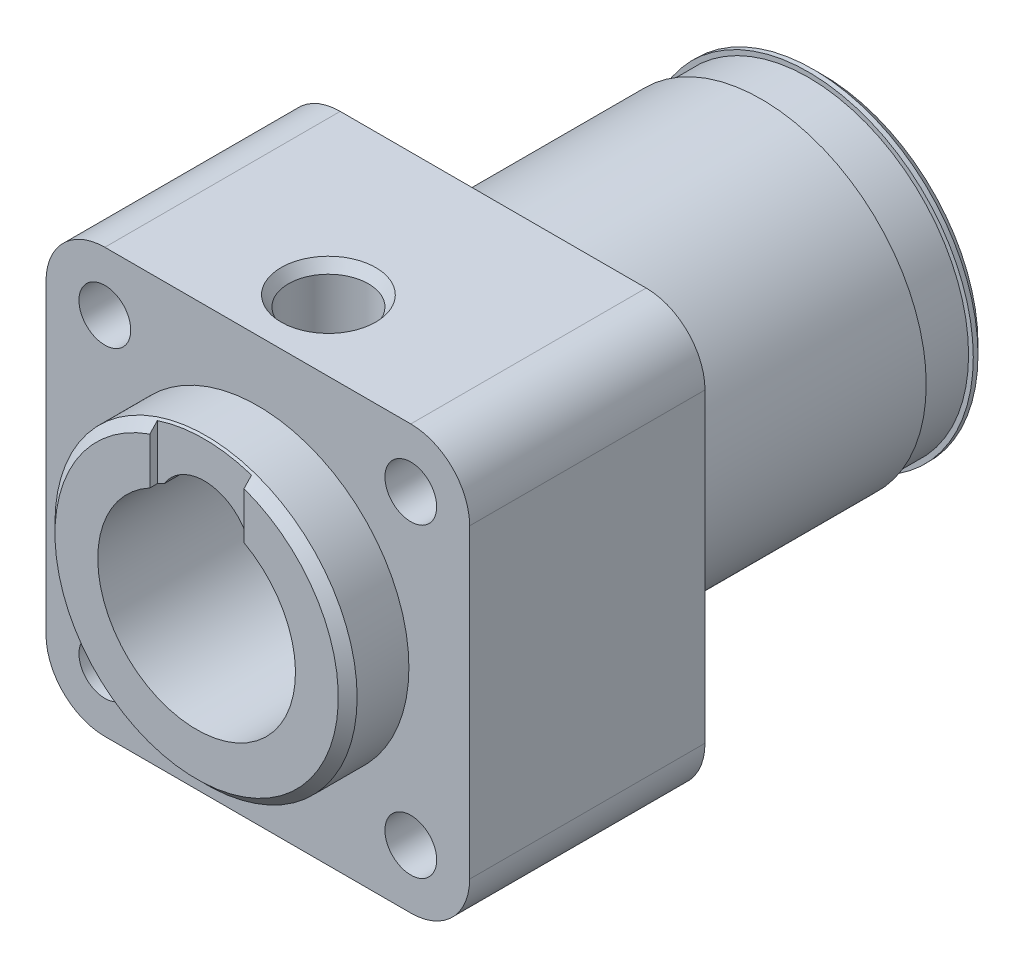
ISO-10303-21;
HEADER;
FILE_DESCRIPTION(('STEP AP214'),'2;1');
FILE_NAME('part.step','',(''),(''),'','','');
FILE_SCHEMA(('AUTOMOTIVE_DESIGN { 1 0 10303 214 1 1 1 1 }'));
ENDSEC;
DATA;
#1=APPLICATION_CONTEXT('core data for automotive mechanical design processes');
#2=APPLICATION_PROTOCOL_DEFINITION('international standard','automotive_design',2000,#1);
#3=PRODUCT_CONTEXT('',#1,'mechanical');
#4=PRODUCT('Part','Part','',(#3));
#5=PRODUCT_RELATED_PRODUCT_CATEGORY('part','',(#4));
#6=PRODUCT_DEFINITION_FORMATION('','',#4);
#7=PRODUCT_DEFINITION_CONTEXT('part definition',#1,'design');
#8=PRODUCT_DEFINITION('design','',#6,#7);
#9=PRODUCT_DEFINITION_SHAPE('','',#8);
#10=(LENGTH_UNIT() NAMED_UNIT(*) SI_UNIT(.MILLI.,.METRE.));
#11=(NAMED_UNIT(*) PLANE_ANGLE_UNIT() SI_UNIT($,.RADIAN.));
#12=(NAMED_UNIT(*) SI_UNIT($,.STERADIAN.) SOLID_ANGLE_UNIT());
#13=UNCERTAINTY_MEASURE_WITH_UNIT(LENGTH_MEASURE(1.E-05),#10,'distance_accuracy_value','');
#14=(GEOMETRIC_REPRESENTATION_CONTEXT(3) GLOBAL_UNCERTAINTY_ASSIGNED_CONTEXT((#13)) GLOBAL_UNIT_ASSIGNED_CONTEXT((#10,
#11,#12)) REPRESENTATION_CONTEXT('',''));
#15=CARTESIAN_POINT('',(0.,0.,0.));
#16=DIRECTION('',(0.,0.,1.));
#17=DIRECTION('',(1.,0.,0.));
#18=AXIS2_PLACEMENT_3D('',#15,#16,#17);
#19=CARTESIAN_POINT('',(0.,9.13665856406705,35.));
#20=DIRECTION('',(0.,0.,1.));
#21=DIRECTION('',(1.,0.,0.));
#22=AXIS2_PLACEMENT_3D('',#19,#20,#21);
#23=PLANE('',#22);
#24=CARTESIAN_POINT('',(-16.25,16.25,35.));
#25=DIRECTION('',(0.,0.,1.));
#26=DIRECTION('',(1.,0.,0.));
#27=AXIS2_PLACEMENT_3D('',#24,#25,#26);
#28=CIRCLE('',#27,2.74999999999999);
#29=CARTESIAN_POINT('',(-13.5,16.25,35.));
#30=VERTEX_POINT('',#29);
#31=EDGE_CURVE('E749',#30,#30,#28,.T.);
#32=ORIENTED_EDGE('',*,*,#31,.T.);
#33=EDGE_LOOP('',(#32));
#34=FACE_BOUND('',#33,.T.);
#35=CARTESIAN_POINT('',(16.25,16.25,35.));
#36=DIRECTION('',(0.,0.,1.));
#37=DIRECTION('',(1.,0.,0.));
#38=AXIS2_PLACEMENT_3D('',#35,#36,#37);
#39=CIRCLE('',#38,2.74999999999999);
#40=CARTESIAN_POINT('',(19.,16.25,35.));
#41=VERTEX_POINT('',#40);
#42=EDGE_CURVE('E743',#41,#41,#39,.T.);
#43=ORIENTED_EDGE('',*,*,#42,.T.);
#44=EDGE_LOOP('',(#43));
#45=FACE_BOUND('',#44,.T.);
#46=CARTESIAN_POINT('',(16.25,-16.25,35.));
#47=DIRECTION('',(0.,0.,1.));
#48=DIRECTION('',(1.,0.,0.));
#49=AXIS2_PLACEMENT_3D('',#46,#47,#48);
#50=CIRCLE('',#49,2.74999999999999);
#51=CARTESIAN_POINT('',(19.,-16.25,35.));
#52=VERTEX_POINT('',#51);
#53=EDGE_CURVE('E737',#52,#52,#50,.T.);
#54=ORIENTED_EDGE('',*,*,#53,.T.);
#55=EDGE_LOOP('',(#54));
#56=FACE_BOUND('',#55,.T.);
#57=CARTESIAN_POINT('',(-16.25,-16.25,35.));
#58=DIRECTION('',(0.,0.,1.));
#59=DIRECTION('',(1.,0.,0.));
#60=AXIS2_PLACEMENT_3D('',#57,#58,#59);
#61=CIRCLE('',#60,2.74999999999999);
#62=CARTESIAN_POINT('',(-13.5,-16.25,35.));
#63=VERTEX_POINT('',#62);
#64=EDGE_CURVE('E730',#63,#63,#61,.T.);
#65=ORIENTED_EDGE('',*,*,#64,.T.);
#66=EDGE_LOOP('',(#65));
#67=FACE_BOUND('',#66,.T.);
#68=CARTESIAN_POINT('',(0.,0.,35.));
#69=DIRECTION('',(0.,0.,1.));
#70=DIRECTION('',(1.,0.,0.));
#71=AXIS2_PLACEMENT_3D('',#68,#69,#70);
#72=CIRCLE('',#71,17.5);
#73=CARTESIAN_POINT('',(17.5,0.,35.));
#74=VERTEX_POINT('',#73);
#75=EDGE_CURVE('E368',#74,#74,#72,.T.);
#76=ORIENTED_EDGE('',*,*,#75,.T.);
#77=EDGE_LOOP('',(#76));
#78=FACE_BOUND('',#77,.T.);
#79=CARTESIAN_POINT('',(-16.25,-16.25,35.));
#80=DIRECTION('',(0.,0.,1.));
#81=DIRECTION('',(1.,0.,0.));
#82=AXIS2_PLACEMENT_3D('',#79,#80,#81);
#83=CIRCLE('',#82,6.25);
#84=CARTESIAN_POINT('',(-22.5,-16.25,35.));
#85=VERTEX_POINT('',#84);
#86=CARTESIAN_POINT('',(-16.25,-22.5,35.));
#87=VERTEX_POINT('',#86);
#88=EDGE_CURVE('E290',#85,#87,#83,.T.);
#89=ORIENTED_EDGE('',*,*,#88,.F.);
#90=DIRECTION('',(0.,-1.,0.));
#91=VECTOR('',#90,1.);
#92=CARTESIAN_POINT('',(-22.5,9.13665856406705,35.));
#93=LINE('',#92,#91);
#94=CARTESIAN_POINT('',(-22.5,16.25,35.));
#95=VERTEX_POINT('',#94);
#96=EDGE_CURVE('E288',#95,#85,#93,.T.);
#97=ORIENTED_EDGE('',*,*,#96,.F.);
#98=CARTESIAN_POINT('',(-16.25,16.25,35.));
#99=DIRECTION('',(0.,0.,1.));
#100=DIRECTION('',(1.,0.,0.));
#101=AXIS2_PLACEMENT_3D('',#98,#99,#100);
#102=CIRCLE('',#101,6.25);
#103=CARTESIAN_POINT('',(-16.25,22.5,35.));
#104=VERTEX_POINT('',#103);
#105=EDGE_CURVE('E286',#104,#95,#102,.T.);
#106=ORIENTED_EDGE('',*,*,#105,.F.);
#107=DIRECTION('',(-1.,0.,0.));
#108=VECTOR('',#107,1.);
#109=CARTESIAN_POINT('',(0.,22.5,35.));
#110=LINE('',#109,#108);
#111=CARTESIAN_POINT('',(16.25,22.5,35.));
#112=VERTEX_POINT('',#111);
#113=EDGE_CURVE('E284',#112,#104,#110,.T.);
#114=ORIENTED_EDGE('',*,*,#113,.F.);
#115=CARTESIAN_POINT('',(16.25,16.25,35.));
#116=DIRECTION('',(0.,0.,1.));
#117=DIRECTION('',(1.,0.,0.));
#118=AXIS2_PLACEMENT_3D('',#115,#116,#117);
#119=CIRCLE('',#118,6.25);
#120=CARTESIAN_POINT('',(22.5,16.25,35.));
#121=VERTEX_POINT('',#120);
#122=EDGE_CURVE('E282',#121,#112,#119,.T.);
#123=ORIENTED_EDGE('',*,*,#122,.F.);
#124=DIRECTION('',(0.,1.,0.));
#125=VECTOR('',#124,1.);
#126=CARTESIAN_POINT('',(22.5,9.13665856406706,35.));
#127=LINE('',#126,#125);
#128=CARTESIAN_POINT('',(22.5,-16.25,35.));
#129=VERTEX_POINT('',#128);
#130=EDGE_CURVE('E280',#129,#121,#127,.T.);
#131=ORIENTED_EDGE('',*,*,#130,.F.);
#132=CARTESIAN_POINT('',(16.25,-16.25,35.));
#133=DIRECTION('',(0.,0.,1.));
#134=DIRECTION('',(1.,0.,0.));
#135=AXIS2_PLACEMENT_3D('',#132,#133,#134);
#136=CIRCLE('',#135,6.25);
#137=CARTESIAN_POINT('',(16.25,-22.5,35.));
#138=VERTEX_POINT('',#137);
#139=EDGE_CURVE('E278',#138,#129,#136,.T.);
#140=ORIENTED_EDGE('',*,*,#139,.F.);
#141=DIRECTION('',(1.,0.,0.));
#142=VECTOR('',#141,1.);
#143=CARTESIAN_POINT('',(0.,-22.5,35.));
#144=LINE('',#143,#142);
#145=EDGE_CURVE('E262',#87,#138,#144,.T.);
#146=ORIENTED_EDGE('',*,*,#145,.F.);
#147=EDGE_LOOP('',(#89,#97,#106,#114,#123,#131,#140,#146));
#148=FACE_BOUND('',#147,.T.);
#149=ADVANCED_FACE('F52',(#34,#45,#56,#67,#78,#148),#23,.F.);
#150=CARTESIAN_POINT('',(0.,0.,60.));
#151=DIRECTION('',(0.,0.,1.));
#152=DIRECTION('',(1.,0.,0.));
#153=AXIS2_PLACEMENT_3D('',#150,#151,#152);
#154=PLANE('',#153);
#155=CARTESIAN_POINT('',(-16.25,16.25,60.));
#156=DIRECTION('',(0.,0.,1.));
#157=DIRECTION('',(1.,0.,0.));
#158=AXIS2_PLACEMENT_3D('',#155,#156,#157);
#159=CIRCLE('',#158,2.74999999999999);
#160=CARTESIAN_POINT('',(-13.5,16.25,60.));
#161=VERTEX_POINT('',#160);
#162=EDGE_CURVE('E750',#161,#161,#159,.T.);
#163=ORIENTED_EDGE('',*,*,#162,.F.);
#164=EDGE_LOOP('',(#163));
#165=FACE_BOUND('',#164,.T.);
#166=CARTESIAN_POINT('',(16.25,16.25,60.));
#167=DIRECTION('',(0.,0.,1.));
#168=DIRECTION('',(1.,0.,0.));
#169=AXIS2_PLACEMENT_3D('',#166,#167,#168);
#170=CIRCLE('',#169,2.74999999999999);
#171=CARTESIAN_POINT('',(19.,16.25,60.));
#172=VERTEX_POINT('',#171);
#173=EDGE_CURVE('E746',#172,#172,#170,.T.);
#174=ORIENTED_EDGE('',*,*,#173,.F.);
#175=EDGE_LOOP('',(#174));
#176=FACE_BOUND('',#175,.T.);
#177=CARTESIAN_POINT('',(16.25,-16.25,60.));
#178=DIRECTION('',(0.,0.,1.));
#179=DIRECTION('',(1.,0.,0.));
#180=AXIS2_PLACEMENT_3D('',#177,#178,#179);
#181=CIRCLE('',#180,2.74999999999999);
#182=CARTESIAN_POINT('',(19.,-16.25,60.));
#183=VERTEX_POINT('',#182);
#184=EDGE_CURVE('E740',#183,#183,#181,.T.);
#185=ORIENTED_EDGE('',*,*,#184,.F.);
#186=EDGE_LOOP('',(#185));
#187=FACE_BOUND('',#186,.T.);
#188=CARTESIAN_POINT('',(-16.25,-16.25,60.));
#189=DIRECTION('',(0.,0.,1.));
#190=DIRECTION('',(1.,0.,0.));
#191=AXIS2_PLACEMENT_3D('',#188,#189,#190);
#192=CIRCLE('',#191,2.74999999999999);
#193=CARTESIAN_POINT('',(-13.5,-16.25,60.));
#194=VERTEX_POINT('',#193);
#195=EDGE_CURVE('E732',#194,#194,#192,.T.);
#196=ORIENTED_EDGE('',*,*,#195,.F.);
#197=EDGE_LOOP('',(#196));
#198=FACE_BOUND('',#197,.T.);
#199=CARTESIAN_POINT('',(0.,0.,60.));
#200=DIRECTION('',(0.,0.,1.));
#201=DIRECTION('',(1.,0.,0.));
#202=AXIS2_PLACEMENT_3D('',#199,#200,#201);
#203=CIRCLE('',#202,16.05);
#204=CARTESIAN_POINT('',(16.05,0.,60.));
#205=VERTEX_POINT('',#204);
#206=EDGE_CURVE('E293',#205,#205,#203,.T.);
#207=ORIENTED_EDGE('',*,*,#206,.F.);
#208=EDGE_LOOP('',(#207));
#209=FACE_BOUND('',#208,.T.);
#210=DIRECTION('',(0.,-1.,0.));
#211=VECTOR('',#210,1.);
#212=CARTESIAN_POINT('',(-22.5,16.25,60.));
#213=LINE('',#212,#211);
#214=CARTESIAN_POINT('',(-22.5,16.25,60.));
#215=VERTEX_POINT('',#214);
#216=CARTESIAN_POINT('',(-22.5,-16.25,60.));
#217=VERTEX_POINT('',#216);
#218=EDGE_CURVE('E256',#215,#217,#213,.T.);
#219=ORIENTED_EDGE('',*,*,#218,.T.);
#220=CARTESIAN_POINT('',(-16.25,-16.25,60.));
#221=DIRECTION('',(0.,0.,1.));
#222=DIRECTION('',(1.,0.,0.));
#223=AXIS2_PLACEMENT_3D('',#220,#221,#222);
#224=CIRCLE('',#223,6.25);
#225=CARTESIAN_POINT('',(-16.25,-22.5,60.));
#226=VERTEX_POINT('',#225);
#227=EDGE_CURVE('E712',#217,#226,#224,.T.);
#228=ORIENTED_EDGE('',*,*,#227,.T.);
#229=DIRECTION('',(1.,0.,0.));
#230=VECTOR('',#229,1.);
#231=CARTESIAN_POINT('',(-16.25,-22.5,60.));
#232=LINE('',#231,#230);
#233=CARTESIAN_POINT('',(16.25,-22.5,60.));
#234=VERTEX_POINT('',#233);
#235=EDGE_CURVE('E243',#226,#234,#232,.T.);
#236=ORIENTED_EDGE('',*,*,#235,.T.);
#237=CARTESIAN_POINT('',(16.25,-16.25,60.));
#238=DIRECTION('',(0.,0.,1.));
#239=DIRECTION('',(1.,0.,0.));
#240=AXIS2_PLACEMENT_3D('',#237,#238,#239);
#241=CIRCLE('',#240,6.25);
#242=CARTESIAN_POINT('',(22.5,-16.25,60.));
#243=VERTEX_POINT('',#242);
#244=EDGE_CURVE('E237',#234,#243,#241,.T.);
#245=ORIENTED_EDGE('',*,*,#244,.T.);
#246=DIRECTION('',(0.,1.,0.));
#247=VECTOR('',#246,1.);
#248=CARTESIAN_POINT('',(22.5,16.25,60.));
#249=LINE('',#248,#247);
#250=CARTESIAN_POINT('',(22.5,16.25,60.));
#251=VERTEX_POINT('',#250);
#252=EDGE_CURVE('E242',#243,#251,#249,.T.);
#253=ORIENTED_EDGE('',*,*,#252,.T.);
#254=CARTESIAN_POINT('',(16.25,16.25,60.));
#255=DIRECTION('',(0.,0.,1.));
#256=DIRECTION('',(1.,0.,0.));
#257=AXIS2_PLACEMENT_3D('',#254,#255,#256);
#258=CIRCLE('',#257,6.25);
#259=CARTESIAN_POINT('',(16.25,22.5,60.));
#260=VERTEX_POINT('',#259);
#261=EDGE_CURVE('E247',#251,#260,#258,.T.);
#262=ORIENTED_EDGE('',*,*,#261,.T.);
#263=DIRECTION('',(-1.,0.,0.));
#264=VECTOR('',#263,1.);
#265=CARTESIAN_POINT('',(-16.25,22.5,60.));
#266=LINE('',#265,#264);
#267=CARTESIAN_POINT('',(-16.25,22.5,60.));
#268=VERTEX_POINT('',#267);
#269=EDGE_CURVE('E250',#260,#268,#266,.T.);
#270=ORIENTED_EDGE('',*,*,#269,.T.);
#271=CARTESIAN_POINT('',(-16.25,16.25,60.));
#272=DIRECTION('',(0.,0.,1.));
#273=DIRECTION('',(1.,0.,0.));
#274=AXIS2_PLACEMENT_3D('',#271,#272,#273);
#275=CIRCLE('',#274,6.25);
#276=EDGE_CURVE('E253',#268,#215,#275,.T.);
#277=ORIENTED_EDGE('',*,*,#276,.T.);
#278=EDGE_LOOP('',(#219,#228,#236,#245,#253,#262,#270,#277));
#279=FACE_BOUND('',#278,.T.);
#280=ADVANCED_FACE('F323',(#165,#176,#187,#198,#209,#279),#154,.T.);
#281=CARTESIAN_POINT('',(0.,0.,66.5));
#282=DIRECTION('',(0.,0.,1.));
#283=DIRECTION('',(1.,0.,0.));
#284=AXIS2_PLACEMENT_3D('',#281,#282,#283);
#285=PLANE('',#284);
#286=DIRECTION('',(0.,-1.,0.));
#287=VECTOR('',#286,1.);
#288=CARTESIAN_POINT('',(-4.97008733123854,7.9889982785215,66.5));
#289=LINE('',#288,#287);
#290=CARTESIAN_POINT('',(-4.97008733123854,14.2056584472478,66.5));
#291=VERTEX_POINT('',#290);
#292=CARTESIAN_POINT('',(-4.97008733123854,9.2492287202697,66.5));
#293=VERTEX_POINT('',#292);
#294=EDGE_CURVE('E163',#291,#293,#289,.T.);
#295=ORIENTED_EDGE('',*,*,#294,.F.);
#296=CARTESIAN_POINT('',(0.,0.,66.5));
#297=DIRECTION('',(0.,0.,1.));
#298=DIRECTION('',(1.,0.,0.));
#299=AXIS2_PLACEMENT_3D('',#296,#297,#298);
#300=CIRCLE('',#299,15.05);
#301=CARTESIAN_POINT('',(5.02991266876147,14.1845859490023,66.5));
#302=VERTEX_POINT('',#301);
#303=EDGE_CURVE('E174',#291,#302,#300,.T.);
#304=ORIENTED_EDGE('',*,*,#303,.T.);
#305=DIRECTION('',(0.,1.,0.));
#306=VECTOR('',#305,1.);
#307=CARTESIAN_POINT('',(5.02991266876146,7.9889982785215,66.5));
#308=LINE('',#307,#306);
#309=CARTESIAN_POINT('',(5.02991266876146,9.21683126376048,66.5));
#310=VERTEX_POINT('',#309);
#311=EDGE_CURVE('E177',#310,#302,#308,.T.);
#312=ORIENTED_EDGE('',*,*,#311,.F.);
#313=CARTESIAN_POINT('',(0.,0.,66.5));
#314=DIRECTION('',(0.,0.,-1.));
#315=DIRECTION('',(-1.,0.,0.));
#316=AXIS2_PLACEMENT_3D('',#313,#314,#315);
#317=CIRCLE('',#316,10.5);
#318=EDGE_CURVE('E176',#310,#293,#317,.T.);
#319=ORIENTED_EDGE('',*,*,#318,.T.);
#320=EDGE_LOOP('',(#295,#304,#312,#319));
#321=FACE_BOUND('',#320,.T.);
#322=ADVANCED_FACE('F172',(#321),#285,.T.);
#323=CARTESIAN_POINT('',(0.,0.,0.));
#324=DIRECTION('',(0.,0.,-1.));
#325=DIRECTION('',(-1.,0.,0.));
#326=AXIS2_PLACEMENT_3D('',#323,#324,#325);
#327=CYLINDRICAL_SURFACE('',#326,10.5);
#328=ORIENTED_EDGE('',*,*,#318,.F.);
#329=DIRECTION('',(0.,0.,-1.));
#330=VECTOR('',#329,1.);
#331=CARTESIAN_POINT('',(5.02991266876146,9.21683126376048,0.));
#332=LINE('',#331,#330);
#333=CARTESIAN_POINT('',(5.02991266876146,9.21683126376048,65.7));
#334=VERTEX_POINT('',#333);
#335=EDGE_CURVE('E805',#310,#334,#332,.T.);
#336=ORIENTED_EDGE('',*,*,#335,.T.);
#337=CARTESIAN_POINT('',(0.,0.,65.7));
#338=DIRECTION('',(0.,0.,-1.));
#339=DIRECTION('',(-1.,0.,0.));
#340=AXIS2_PLACEMENT_3D('',#337,#338,#339);
#341=CIRCLE('',#340,10.5);
#342=CARTESIAN_POINT('',(4.30463640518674,9.57706141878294,65.7));
#343=VERTEX_POINT('',#342);
#344=EDGE_CURVE('E812',#334,#343,#341,.F.);
#345=ORIENTED_EDGE('',*,*,#344,.T.);
#346=DIRECTION('',(0.,0.,1.));
#347=VECTOR('',#346,1.);
#348=CARTESIAN_POINT('',(4.30463640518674,9.57706141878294,47.5));
#349=LINE('',#348,#347);
#350=CARTESIAN_POINT('',(4.30463640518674,9.57706141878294,47.5));
#351=VERTEX_POINT('',#350);
#352=EDGE_CURVE('E226',#351,#343,#349,.T.);
#353=ORIENTED_EDGE('',*,*,#352,.F.);
#354=CARTESIAN_POINT('',(0.,0.,47.5));
#355=DIRECTION('',(0.,0.,-1.));
#356=DIRECTION('',(-1.,0.,0.));
#357=AXIS2_PLACEMENT_3D('',#354,#355,#356);
#358=CIRCLE('',#357,10.5);
#359=CARTESIAN_POINT('',(-4.24999999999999,9.60143218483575,47.5));
#360=VERTEX_POINT('',#359);
#361=EDGE_CURVE('E790',#351,#360,#358,.F.);
#362=ORIENTED_EDGE('',*,*,#361,.T.);
#363=DIRECTION('',(0.,0.,1.));
#364=VECTOR('',#363,1.);
#365=CARTESIAN_POINT('',(-4.24999999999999,9.60143218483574,47.5));
#366=LINE('',#365,#364);
#367=CARTESIAN_POINT('',(-4.24999999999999,9.60143218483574,52.5));
#368=VERTEX_POINT('',#367);
#369=EDGE_CURVE('E227',#360,#368,#366,.T.);
#370=ORIENTED_EDGE('',*,*,#369,.T.);
#371=CARTESIAN_POINT('',(-4.24999999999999,9.60143218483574,65.7));
#372=VERTEX_POINT('',#371);
#373=EDGE_CURVE('E800',#368,#372,#366,.T.);
#374=ORIENTED_EDGE('',*,*,#373,.T.);
#375=CARTESIAN_POINT('',(-4.97008733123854,9.2492287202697,65.7));
#376=VERTEX_POINT('',#375);
#377=EDGE_CURVE('E72',#372,#376,#341,.F.);
#378=ORIENTED_EDGE('',*,*,#377,.T.);
#379=DIRECTION('',(0.,0.,-1.));
#380=VECTOR('',#379,1.);
#381=CARTESIAN_POINT('',(-4.97008733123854,9.2492287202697,0.));
#382=LINE('',#381,#380);
#383=EDGE_CURVE('E803',#376,#293,#382,.F.);
#384=ORIENTED_EDGE('',*,*,#383,.T.);
#385=EDGE_LOOP('',(#328,#336,#345,#353,#362,#370,#374,#378,#384));
#386=FACE_BOUND('',#385,.T.);
#387=CARTESIAN_POINT('',(0.,0.,32.));
#388=DIRECTION('',(0.,0.,-1.));
#389=DIRECTION('',(-1.,0.,0.));
#390=AXIS2_PLACEMENT_3D('',#387,#388,#389);
#391=CIRCLE('',#390,10.5);
#392=CARTESIAN_POINT('',(-10.5,0.,32.));
#393=VERTEX_POINT('',#392);
#394=EDGE_CURVE('E202',#393,#393,#391,.F.);
#395=ORIENTED_EDGE('',*,*,#394,.F.);
#396=EDGE_LOOP('',(#395));
#397=FACE_BOUND('',#396,.T.);
#398=ADVANCED_FACE('F337',(#386,#397),#327,.F.);
#399=CARTESIAN_POINT('',(0.,0.,66.5));
#400=DIRECTION('',(0.,0.,1.));
#401=DIRECTION('',(1.,0.,0.));
#402=AXIS2_PLACEMENT_3D('',#399,#400,#401);
#403=CYLINDRICAL_SURFACE('',#402,17.5);
#404=CARTESIAN_POINT('',(0.,0.,1.));
#405=DIRECTION('',(0.,0.,1.));
#406=DIRECTION('',(1.,0.,0.));
#407=AXIS2_PLACEMENT_3D('',#404,#405,#406);
#408=CIRCLE('',#407,17.5);
#409=CARTESIAN_POINT('',(17.5,0.,1.));
#410=VERTEX_POINT('',#409);
#411=EDGE_CURVE('E182',#410,#410,#408,.T.);
#412=ORIENTED_EDGE('',*,*,#411,.T.);
#413=EDGE_LOOP('',(#412));
#414=FACE_BOUND('',#413,.T.);
#415=CARTESIAN_POINT('',(0.,0.,1.5));
#416=DIRECTION('',(0.,0.,1.));
#417=DIRECTION('',(1.,0.,0.));
#418=AXIS2_PLACEMENT_3D('',#415,#416,#417);
#419=CIRCLE('',#418,17.5);
#420=CARTESIAN_POINT('',(17.5,0.,1.5));
#421=VERTEX_POINT('',#420);
#422=EDGE_CURVE('E201',#421,#421,#419,.T.);
#423=ORIENTED_EDGE('',*,*,#422,.F.);
#424=EDGE_LOOP('',(#423));
#425=FACE_BOUND('',#424,.T.);
#426=ADVANCED_FACE('F341',(#414,#425),#403,.T.);
#427=ORIENTED_EDGE('',*,*,#75,.F.);
#428=EDGE_LOOP('',(#427));
#429=FACE_BOUND('',#428,.T.);
#430=CARTESIAN_POINT('',(0.,0.,6.50000000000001));
#431=DIRECTION('',(0.,0.,1.));
#432=DIRECTION('',(1.,0.,0.));
#433=AXIS2_PLACEMENT_3D('',#430,#431,#432);
#434=CIRCLE('',#433,17.5);
#435=CARTESIAN_POINT('',(17.5,0.,6.50000000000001));
#436=VERTEX_POINT('',#435);
#437=EDGE_CURVE('E365',#436,#436,#434,.T.);
#438=ORIENTED_EDGE('',*,*,#437,.T.);
#439=EDGE_LOOP('',(#438));
#440=FACE_BOUND('',#439,.T.);
#441=ADVANCED_FACE('F347',(#429,#440),#403,.T.);
#442=CARTESIAN_POINT('',(0.,9.13665856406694,6.50000000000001));
#443=DIRECTION('',(0.,0.,-1.));
#444=DIRECTION('',(-1.,0.,0.));
#445=AXIS2_PLACEMENT_3D('',#442,#443,#444);
#446=PLANE('',#445);
#447=CARTESIAN_POINT('',(0.,0.,6.50000000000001));
#448=DIRECTION('',(0.,0.,1.));
#449=DIRECTION('',(1.,0.,0.));
#450=AXIS2_PLACEMENT_3D('',#447,#448,#449);
#451=CIRCLE('',#450,17.);
#452=CARTESIAN_POINT('',(17.,0.,6.50000000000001));
#453=VERTEX_POINT('',#452);
#454=EDGE_CURVE('E364',#453,#453,#451,.T.);
#455=ORIENTED_EDGE('',*,*,#454,.T.);
#456=EDGE_LOOP('',(#455));
#457=FACE_BOUND('',#456,.T.);
#458=ORIENTED_EDGE('',*,*,#437,.F.);
#459=EDGE_LOOP('',(#458));
#460=FACE_BOUND('',#459,.T.);
#461=ADVANCED_FACE('F334',(#457,#460),#446,.T.);
#462=CARTESIAN_POINT('',(0.,0.,66.5));
#463=DIRECTION('',(0.,0.,1.));
#464=DIRECTION('',(1.,0.,0.));
#465=AXIS2_PLACEMENT_3D('',#462,#463,#464);
#466=CYLINDRICAL_SURFACE('',#465,17.);
#467=CARTESIAN_POINT('',(0.,0.,1.5));
#468=DIRECTION('',(0.,0.,1.));
#469=DIRECTION('',(1.,0.,0.));
#470=AXIS2_PLACEMENT_3D('',#467,#468,#469);
#471=CIRCLE('',#470,17.);
#472=CARTESIAN_POINT('',(17.,0.,1.5));
#473=VERTEX_POINT('',#472);
#474=EDGE_CURVE('E361',#473,#473,#471,.T.);
#475=ORIENTED_EDGE('',*,*,#474,.T.);
#476=EDGE_LOOP('',(#475));
#477=FACE_BOUND('',#476,.T.);
#478=ORIENTED_EDGE('',*,*,#454,.F.);
#479=EDGE_LOOP('',(#478));
#480=FACE_BOUND('',#479,.T.);
#481=ADVANCED_FACE('F317',(#477,#480),#466,.T.);
#482=CARTESIAN_POINT('',(0.,9.136658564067,1.5));
#483=DIRECTION('',(0.,0.,1.));
#484=DIRECTION('',(1.,0.,0.));
#485=AXIS2_PLACEMENT_3D('',#482,#483,#484);
#486=PLANE('',#485);
#487=ORIENTED_EDGE('',*,*,#422,.T.);
#488=EDGE_LOOP('',(#487));
#489=FACE_BOUND('',#488,.T.);
#490=ORIENTED_EDGE('',*,*,#474,.F.);
#491=EDGE_LOOP('',(#490));
#492=FACE_BOUND('',#491,.T.);
#493=ADVANCED_FACE('F309',(#489,#492),#486,.T.);
#494=CARTESIAN_POINT('',(0.,0.,0.));
#495=DIRECTION('',(0.,0.,1.));
#496=DIRECTION('',(1.,0.,0.));
#497=AXIS2_PLACEMENT_3D('',#494,#495,#496);
#498=PLANE('',#497);
#499=CARTESIAN_POINT('',(0.,0.,0.));
#500=DIRECTION('',(0.,0.,1.));
#501=DIRECTION('',(1.,0.,0.));
#502=AXIS2_PLACEMENT_3D('',#499,#500,#501);
#503=CIRCLE('',#502,16.5);
#504=CARTESIAN_POINT('',(16.5,0.,0.));
#505=VERTEX_POINT('',#504);
#506=EDGE_CURVE('E188',#505,#505,#503,.F.);
#507=ORIENTED_EDGE('',*,*,#506,.T.);
#508=EDGE_LOOP('',(#507));
#509=FACE_BOUND('',#508,.T.);
#510=CARTESIAN_POINT('',(0.,0.,0.));
#511=DIRECTION('',(0.,0.,-1.));
#512=DIRECTION('',(-1.,0.,0.));
#513=AXIS2_PLACEMENT_3D('',#510,#511,#512);
#514=CIRCLE('',#513,14.5);
#515=CARTESIAN_POINT('',(-14.5,0.,0.));
#516=VERTEX_POINT('',#515);
#517=EDGE_CURVE('E203',#516,#516,#514,.T.);
#518=ORIENTED_EDGE('',*,*,#517,.F.);
#519=EDGE_LOOP('',(#518));
#520=FACE_BOUND('',#519,.T.);
#521=ADVANCED_FACE('F306',(#509,#520),#498,.F.);
#522=CARTESIAN_POINT('',(0.,0.,32.));
#523=DIRECTION('',(0.,0.,-1.));
#524=DIRECTION('',(-1.,0.,0.));
#525=AXIS2_PLACEMENT_3D('',#522,#523,#524);
#526=PLANE('',#525);
#527=CARTESIAN_POINT('',(0.,0.,32.));
#528=DIRECTION('',(0.,0.,-1.));
#529=DIRECTION('',(-1.,0.,0.));
#530=AXIS2_PLACEMENT_3D('',#527,#528,#529);
#531=CIRCLE('',#530,14.5);
#532=CARTESIAN_POINT('',(-14.5,0.,32.));
#533=VERTEX_POINT('',#532);
#534=EDGE_CURVE('E295',#533,#533,#531,.T.);
#535=ORIENTED_EDGE('',*,*,#534,.T.);
#536=EDGE_LOOP('',(#535));
#537=FACE_BOUND('',#536,.T.);
#538=ORIENTED_EDGE('',*,*,#394,.T.);
#539=EDGE_LOOP('',(#538));
#540=FACE_BOUND('',#539,.T.);
#541=ADVANCED_FACE('F308',(#537,#540),#526,.T.);
#542=CARTESIAN_POINT('',(0.,0.,32.));
#543=DIRECTION('',(0.,0.,-1.));
#544=DIRECTION('',(-1.,0.,0.));
#545=AXIS2_PLACEMENT_3D('',#542,#543,#544);
#546=CYLINDRICAL_SURFACE('',#545,14.5);
#547=ORIENTED_EDGE('',*,*,#534,.F.);
#548=EDGE_LOOP('',(#547));
#549=FACE_BOUND('',#548,.T.);
#550=ORIENTED_EDGE('',*,*,#517,.T.);
#551=EDGE_LOOP('',(#550));
#552=FACE_BOUND('',#551,.T.);
#553=ADVANCED_FACE('F304',(#549,#552),#546,.F.);
#554=CARTESIAN_POINT('',(0.,0.,0.));
#555=DIRECTION('',(0.,0.,1.));
#556=DIRECTION('',(1.,0.,0.));
#557=AXIS2_PLACEMENT_3D('',#554,#555,#556);
#558=CONICAL_SURFACE('',#557,16.5,0.785398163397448);
#559=ORIENTED_EDGE('',*,*,#411,.F.);
#560=EDGE_LOOP('',(#559));
#561=FACE_BOUND('',#560,.T.);
#562=ORIENTED_EDGE('',*,*,#506,.F.);
#563=EDGE_LOOP('',(#562));
#564=FACE_BOUND('',#563,.T.);
#565=ADVANCED_FACE('F374',(#561,#564),#558,.T.);
#566=CARTESIAN_POINT('',(0.,0.,60.));
#567=DIRECTION('',(0.,0.,1.));
#568=DIRECTION('',(1.,0.,0.));
#569=AXIS2_PLACEMENT_3D('',#566,#567,#568);
#570=CYLINDRICAL_SURFACE('',#569,16.05);
#571=CARTESIAN_POINT('',(0.,0.,65.5));
#572=DIRECTION('',(0.,0.,1.));
#573=DIRECTION('',(1.,0.,0.));
#574=AXIS2_PLACEMENT_3D('',#571,#572,#573);
#575=CIRCLE('',#574,16.05);
#576=CARTESIAN_POINT('',(16.05,0.,65.5));
#577=VERTEX_POINT('',#576);
#578=EDGE_CURVE('E181',#577,#577,#575,.F.);
#579=CARTESIAN_POINT('',(16.05,0.,65.5));
#580=CARTESIAN_POINT('',(16.05,0.,65.4427083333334));
#581=CARTESIAN_POINT('',(16.05,0.,65.3854166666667));
#582=CARTESIAN_POINT('',(16.05,0.,65.2708333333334));
#583=CARTESIAN_POINT('',(16.05,0.,65.2135416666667));
#584=CARTESIAN_POINT('',(16.05,0.,65.0989583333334));
#585=CARTESIAN_POINT('',(16.05,0.,65.0416666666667));
#586=CARTESIAN_POINT('',(16.05,0.,64.9270833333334));
#587=CARTESIAN_POINT('',(16.05,0.,64.8697916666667));
#588=CARTESIAN_POINT('',(16.05,0.,64.7552083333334));
#589=CARTESIAN_POINT('',(16.05,0.,64.6979166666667));
#590=CARTESIAN_POINT('',(16.05,0.,64.5833333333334));
#591=CARTESIAN_POINT('',(16.05,0.,64.5260416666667));
#592=CARTESIAN_POINT('',(16.05,0.,64.4114583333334));
#593=CARTESIAN_POINT('',(16.05,0.,64.3541666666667));
#594=CARTESIAN_POINT('',(16.05,0.,64.2395833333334));
#595=CARTESIAN_POINT('',(16.05,0.,64.1822916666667));
#596=CARTESIAN_POINT('',(16.05,0.,64.0677083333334));
#597=CARTESIAN_POINT('',(16.05,0.,64.0104166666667));
#598=CARTESIAN_POINT('',(16.05,0.,63.8958333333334));
#599=CARTESIAN_POINT('',(16.05,0.,63.8385416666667));
#600=CARTESIAN_POINT('',(16.05,0.,63.7239583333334));
#601=CARTESIAN_POINT('',(16.05,0.,63.6666666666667));
#602=CARTESIAN_POINT('',(16.05,0.,63.5520833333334));
#603=CARTESIAN_POINT('',(16.05,0.,63.4947916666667));
#604=CARTESIAN_POINT('',(16.05,0.,63.3802083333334));
#605=CARTESIAN_POINT('',(16.05,0.,63.3229166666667));
#606=CARTESIAN_POINT('',(16.05,0.,63.2083333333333));
#607=CARTESIAN_POINT('',(16.05,0.,63.1510416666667));
#608=CARTESIAN_POINT('',(16.05,0.,63.0364583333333));
#609=CARTESIAN_POINT('',(16.05,0.,62.9791666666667));
#610=CARTESIAN_POINT('',(16.05,0.,62.8645833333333));
#611=CARTESIAN_POINT('',(16.05,0.,62.8072916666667));
#612=CARTESIAN_POINT('',(16.05,0.,62.6927083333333));
#613=CARTESIAN_POINT('',(16.05,0.,62.6354166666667));
#614=CARTESIAN_POINT('',(16.05,0.,62.5208333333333));
#615=CARTESIAN_POINT('',(16.05,0.,62.4635416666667));
#616=CARTESIAN_POINT('',(16.05,0.,62.3489583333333));
#617=CARTESIAN_POINT('',(16.05,0.,62.2916666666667));
#618=CARTESIAN_POINT('',(16.05,0.,62.1770833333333));
#619=CARTESIAN_POINT('',(16.05,0.,62.1197916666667));
#620=CARTESIAN_POINT('',(16.05,0.,62.0052083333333));
#621=CARTESIAN_POINT('',(16.05,0.,61.9479166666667));
#622=CARTESIAN_POINT('',(16.05,0.,61.8333333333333));
#623=CARTESIAN_POINT('',(16.05,0.,61.7760416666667));
#624=CARTESIAN_POINT('',(16.05,0.,61.6614583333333));
#625=CARTESIAN_POINT('',(16.05,0.,61.6041666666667));
#626=CARTESIAN_POINT('',(16.05,0.,61.4895833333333));
#627=CARTESIAN_POINT('',(16.05,0.,61.4322916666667));
#628=CARTESIAN_POINT('',(16.05,0.,61.3177083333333));
#629=CARTESIAN_POINT('',(16.05,0.,61.2604166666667));
#630=CARTESIAN_POINT('',(16.05,0.,61.1458333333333));
#631=CARTESIAN_POINT('',(16.05,0.,61.0885416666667));
#632=CARTESIAN_POINT('',(16.05,0.,60.9739583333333));
#633=CARTESIAN_POINT('',(16.05,0.,60.9166666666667));
#634=CARTESIAN_POINT('',(16.05,0.,60.8020833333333));
#635=CARTESIAN_POINT('',(16.05,0.,60.7447916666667));
#636=CARTESIAN_POINT('',(16.05,0.,60.6302083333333));
#637=CARTESIAN_POINT('',(16.05,0.,60.5729166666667));
#638=CARTESIAN_POINT('',(16.05,0.,60.4583333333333));
#639=CARTESIAN_POINT('',(16.05,0.,60.4010416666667));
#640=CARTESIAN_POINT('',(16.05,0.,60.2864583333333));
#641=CARTESIAN_POINT('',(16.05,0.,60.2291666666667));
#642=CARTESIAN_POINT('',(16.05,0.,60.1145833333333));
#643=CARTESIAN_POINT('',(16.05,0.,60.0572916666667));
#644=CARTESIAN_POINT('',(16.05,0.,60.));
#645=B_SPLINE_CURVE_WITH_KNOTS('',3,(#579,#580,#581,#582,#583,#584,#585,#586,#587,#588,#589,
#590,#591,#592,#593,#594,#595,#596,#597,#598,#599,#600,#601,#602,#603,#604,#605,#606,#607,#608,
#609,#610,#611,#612,#613,#614,#615,#616,#617,#618,#619,#620,#621,#622,#623,#624,#625,#626,#627,
#628,#629,#630,#631,#632,#633,#634,#635,#636,#637,#638,#639,#640,#641,#642,#643,#644),
.UNSPECIFIED.,.F.,.F.,(4,2,2,2,2,2,2,2,2,2,2,2,2,2,2,2,2,2,2,2,2,2,2,2,2,2,2,2,2,2,2,2,4),(0.,
0.171875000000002,0.343750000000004,0.515625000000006,0.687500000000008,0.859375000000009,
1.03125000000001,1.20312500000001,1.37500000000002,1.54687500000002,1.71875000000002,
1.89062500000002,2.06250000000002,2.23437500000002,2.40625000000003,2.57812500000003,
2.75000000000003,2.92187500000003,3.09375000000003,3.26562500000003,3.43750000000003,
3.60937500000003,3.78125000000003,3.95312500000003,4.12500000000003,4.29687500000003,
4.46875000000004,4.64062500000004,4.81250000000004,4.98437500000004,5.15625000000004,
5.32812500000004,5.50000000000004),.UNSPECIFIED.);
#646=EDGE_CURVE('BSEAM376',#577,#205,#645,.T.);
#647=ORIENTED_EDGE('',*,*,#578,.T.);
#648=ORIENTED_EDGE('',*,*,#206,.T.);
#649=ORIENTED_EDGE('',*,*,#646,.T.);
#650=ORIENTED_EDGE('',*,*,#646,.F.);
#651=EDGE_LOOP('',(#647,#649,#648,#650));
#652=FACE_BOUND('',#651,.T.);
#653=ADVANCED_FACE('F376',(#652),#570,.T.);
#654=CARTESIAN_POINT('',(0.,0.,66.5));
#655=DIRECTION('',(0.,0.,-1.));
#656=DIRECTION('',(-1.,0.,0.));
#657=AXIS2_PLACEMENT_3D('',#654,#655,#656);
#658=CONICAL_SURFACE('',#657,15.05,0.785398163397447);
#659=CARTESIAN_POINT('',(-4.97008733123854,25.4093423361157,55.6591435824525));
#660=CARTESIAN_POINT('',(-4.97008733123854,24.9716447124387,56.0886970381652));
#661=CARTESIAN_POINT('',(-4.97008733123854,24.5337467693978,56.5180464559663));
#662=CARTESIAN_POINT('',(-4.97008733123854,23.6574722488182,57.3762560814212));
#663=CARTESIAN_POINT('',(-4.97008733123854,23.2190956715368,57.8051162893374));
#664=CARTESIAN_POINT('',(-4.97008733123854,21.903361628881,59.0906160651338));
#665=CARTESIAN_POINT('',(-4.97008733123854,21.0251691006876,59.9464014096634));
#666=CARTESIAN_POINT('',(-4.97008733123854,19.2666456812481,61.6537502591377));
#667=CARTESIAN_POINT('',(-4.97008733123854,18.3863184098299,62.5053174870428));
#668=CARTESIAN_POINT('',(-4.97008733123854,17.0621703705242,63.7790946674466));
#669=CARTESIAN_POINT('',(-4.97008733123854,16.6201210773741,64.2031457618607));
#670=CARTESIAN_POINT('',(-4.97008733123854,15.7345247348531,65.0496951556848));
#671=CARTESIAN_POINT('',(-4.97008733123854,15.2909776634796,65.4721934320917));
#672=CARTESIAN_POINT('',(-4.97008733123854,14.4010345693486,66.3161048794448));
#673=CARTESIAN_POINT('',(-4.97008733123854,13.9546344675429,66.7375137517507));
#674=CARTESIAN_POINT('',(-4.97008733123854,13.0593917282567,67.577686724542));
#675=CARTESIAN_POINT('',(-4.97008733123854,12.6105492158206,67.9964509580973));
#676=CARTESIAN_POINT('',(-4.97008733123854,11.7098938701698,68.8301590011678));
#677=CARTESIAN_POINT('',(-4.97008733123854,11.258083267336,69.2451052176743));
#678=CARTESIAN_POINT('',(-4.97008733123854,10.349913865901,70.0701809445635));
#679=CARTESIAN_POINT('',(-4.97008733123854,9.89355423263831,70.480309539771));
#680=CARTESIAN_POINT('',(-4.97008733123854,9.20372595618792,71.0906051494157));
#681=CARTESIAN_POINT('',(-4.97008733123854,8.97263024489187,71.2934535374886));
#682=CARTESIAN_POINT('',(-4.97008733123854,8.50850427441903,71.6969185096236));
#683=CARTESIAN_POINT('',(-4.97008733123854,8.27547405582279,71.8975351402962));
#684=CARTESIAN_POINT('',(-4.97008733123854,7.80717431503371,72.295887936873));
#685=CARTESIAN_POINT('',(-4.97008733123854,7.57190604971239,72.4936255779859));
#686=CARTESIAN_POINT('',(-4.97008733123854,7.09843048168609,72.8855999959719));
#687=CARTESIAN_POINT('',(-4.97008733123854,6.86022293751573,73.0798364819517));
#688=CARTESIAN_POINT('',(-4.97008733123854,6.37953966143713,73.4642465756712));
#689=CARTESIAN_POINT('',(-4.97008733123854,6.13705454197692,73.654408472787));
#690=CARTESIAN_POINT('',(-4.97008733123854,5.64748407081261,74.0286390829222));
#691=CARTESIAN_POINT('',(-4.97008733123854,5.40039981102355,74.212709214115));
#692=CARTESIAN_POINT('',(-4.97008733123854,5.02507482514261,74.4827780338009));
#693=CARTESIAN_POINT('',(-4.97008733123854,4.89906318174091,74.5718755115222));
#694=CARTESIAN_POINT('',(-4.97008733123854,4.64534028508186,74.7476052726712));
#695=CARTESIAN_POINT('',(-4.97008733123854,4.51762913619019,74.8342377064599));
#696=CARTESIAN_POINT('',(-4.97008733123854,4.26017139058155,75.0046592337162));
#697=CARTESIAN_POINT('',(-4.97008733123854,4.13042327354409,75.0884460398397));
#698=CARTESIAN_POINT('',(-4.97008733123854,3.86869661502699,75.2525182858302));
#699=CARTESIAN_POINT('',(-4.97008733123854,3.73671760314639,75.3328029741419));
#700=CARTESIAN_POINT('',(-4.97008733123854,3.60350425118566,75.4110252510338));
#701=B_SPLINE_CURVE_WITH_KNOTS('',3,(#659,#660,#661,#662,#663,#664,#665,#666,#667,#668,#669,
#670,#671,#672,#673,#674,#675,#676,#677,#678,#679,#680,#681,#682,#683,#684,#685,#686,#687,#688,
#689,#690,#691,#692,#693,#694,#695,#696,#697,#698,#699,#700),.UNSPECIFIED.,.F.,.F.,(4,2,2,2,2,2,
2,2,2,2,2,2,2,2,2,2,2,2,2,2,4),(0.,1.83979845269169,3.679595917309,7.35822056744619,
11.0326154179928,12.8702856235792,14.7079829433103,16.5496393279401,18.3912022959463,
20.2315114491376,22.0721647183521,22.9946365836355,23.9170891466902,24.8390511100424,
25.7610893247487,26.6854946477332,27.6096832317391,28.0726454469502,28.5355793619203,
28.9988769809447,29.4622735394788),.UNSPECIFIED.);
#702=CARTESIAN_POINT('',(-4.97008733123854,15.0506056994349,65.7));
#703=VERTEX_POINT('',#702);
#704=EDGE_CURVE('E13',#703,#291,#701,.T.);
#705=ORIENTED_EDGE('',*,*,#704,.F.);
#706=CARTESIAN_POINT('',(0.,0.,65.7));
#707=DIRECTION('',(0.,0.,-1.));
#708=DIRECTION('',(-1.,0.,0.));
#709=AXIS2_PLACEMENT_3D('',#706,#707,#708);
#710=CIRCLE('',#709,15.85);
#711=CARTESIAN_POINT('',(5.02991266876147,15.0307178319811,65.7));
#712=VERTEX_POINT('',#711);
#713=EDGE_CURVE('E810',#712,#703,#710,.F.);
#714=ORIENTED_EDGE('',*,*,#713,.F.);
#715=CARTESIAN_POINT('',(5.02991266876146,3.57446309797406,75.3793591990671));
#716=CARTESIAN_POINT('',(5.02991266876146,3.7065551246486,75.3028160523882));
#717=CARTESIAN_POINT('',(5.02991266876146,3.83742996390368,75.2242120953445));
#718=CARTESIAN_POINT('',(5.02991266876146,4.09697202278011,75.0634961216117));
#719=CARTESIAN_POINT('',(5.02991266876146,4.22563971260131,74.9813848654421));
#720=CARTESIAN_POINT('',(5.02991266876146,4.48094852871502,74.8143013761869));
#721=CARTESIAN_POINT('',(5.02991266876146,4.60759119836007,74.7293314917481));
#722=CARTESIAN_POINT('',(5.02991266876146,4.85918372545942,74.5569103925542));
#723=CARTESIAN_POINT('',(5.02991266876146,4.98413347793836,74.469459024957));
#724=CARTESIAN_POINT('',(5.02991266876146,5.35626213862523,74.2043066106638));
#725=CARTESIAN_POINT('',(5.02991266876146,5.60121458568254,74.0234796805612));
#726=CARTESIAN_POINT('',(5.02991266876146,6.08650511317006,73.6556617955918));
#727=CARTESIAN_POINT('',(5.02991266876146,6.32684207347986,73.46866937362));
#728=CARTESIAN_POINT('',(5.02991266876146,6.80317811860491,73.0905472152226));
#729=CARTESIAN_POINT('',(5.02991266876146,7.03918712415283,72.8994299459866));
#730=CARTESIAN_POINT('',(5.02991266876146,7.50823661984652,72.5136363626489));
#731=CARTESIAN_POINT('',(5.02991266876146,7.74127735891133,72.3189603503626));
#732=CARTESIAN_POINT('',(5.02991266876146,8.20509718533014,71.9266781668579));
#733=CARTESIAN_POINT('',(5.02991266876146,8.43587494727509,71.7290704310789));
#734=CARTESIAN_POINT('',(5.02991266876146,8.89546821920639,71.3315797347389));
#735=CARTESIAN_POINT('',(5.02991266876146,9.12428368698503,71.1316967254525));
#736=CARTESIAN_POINT('',(5.02991266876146,9.81823129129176,70.5205534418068));
#737=CARTESIAN_POINT('',(5.02991266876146,10.2807962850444,70.1063790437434));
#738=CARTESIAN_POINT('',(5.02991266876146,11.2011043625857,69.2729097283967));
#739=CARTESIAN_POINT('',(5.02991266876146,11.6588483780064,68.8536158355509));
#740=CARTESIAN_POINT('',(5.02991266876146,12.5714585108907,68.0107622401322));
#741=CARTESIAN_POINT('',(5.02991266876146,13.0263202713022,67.5871978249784));
#742=CARTESIAN_POINT('',(5.02991266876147,13.9334761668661,66.7372794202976));
#743=CARTESIAN_POINT('',(5.02991266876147,14.3857701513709,66.3109252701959));
#744=CARTESIAN_POINT('',(5.02991266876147,15.2826411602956,65.4615355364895));
#745=CARTESIAN_POINT('',(5.02991266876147,15.7272433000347,65.0385264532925));
#746=CARTESIAN_POINT('',(5.02991266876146,16.6149170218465,64.1909049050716));
#747=CARTESIAN_POINT('',(5.02991266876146,17.0579886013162,63.7662924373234));
#748=CARTESIAN_POINT('',(5.02991266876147,18.3853700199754,62.4905750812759));
#749=CARTESIAN_POINT('',(5.02991266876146,19.2678602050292,61.6375772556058));
#750=CARTESIAN_POINT('',(5.02991266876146,21.0272013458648,59.9306027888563));
#751=CARTESIAN_POINT('',(5.02991266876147,21.9040611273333,59.0766352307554));
#752=CARTESIAN_POINT('',(5.02991266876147,23.2176461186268,57.7939423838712));
#753=CARTESIAN_POINT('',(5.02991266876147,23.6552228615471,57.3660886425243));
#754=CARTESIAN_POINT('',(5.02991266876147,24.5298877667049,56.50988295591));
#755=CARTESIAN_POINT('',(5.02991266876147,24.9669759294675,56.0815310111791));
#756=CARTESIAN_POINT('',(5.02991266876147,25.4038598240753,55.6529709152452));
#757=B_SPLINE_CURVE_WITH_KNOTS('',3,(#715,#716,#717,#718,#719,#720,#721,#722,#723,#724,#725,
#726,#727,#728,#729,#730,#731,#732,#733,#734,#735,#736,#737,#738,#739,#740,#741,#742,#743,#744,
#745,#746,#747,#748,#749,#750,#751,#752,#753,#754,#755,#756),.UNSPECIFIED.,.F.,.F.,(4,2,2,2,2,2,
2,2,2,2,2,2,2,2,2,2,2,2,2,2,4),(0.,0.457952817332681,0.915806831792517,1.37329344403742,
1.8308082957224,2.7440604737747,3.6575315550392,4.56854811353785,5.47948776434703,
6.39093241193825,7.30239661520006,9.16500468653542,11.0272459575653,12.8918355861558,
14.7565334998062,16.5975796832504,18.438628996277,22.1206710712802,25.7926262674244,
27.6285970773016,29.464565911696),.UNSPECIFIED.);
#758=EDGE_CURVE('E65',#302,#712,#757,.T.);
#759=ORIENTED_EDGE('',*,*,#758,.F.);
#760=ORIENTED_EDGE('',*,*,#303,.F.);
#761=EDGE_LOOP('',(#705,#714,#759,#760));
#762=FACE_BOUND('',#761,.T.);
#763=ORIENTED_EDGE('',*,*,#578,.F.);
#764=EDGE_LOOP('',(#763));
#765=FACE_BOUND('',#764,.T.);
#766=ADVANCED_FACE('F54',(#762,#765),#658,.T.);
#767=CARTESIAN_POINT('',(-16.25,-16.25,31.5));
#768=DIRECTION('',(0.,0.,1.));
#769=DIRECTION('',(1.,0.,0.));
#770=AXIS2_PLACEMENT_3D('',#767,#768,#769);
#771=CYLINDRICAL_SURFACE('',#770,6.25);
#772=ORIENTED_EDGE('',*,*,#88,.T.);
#773=DIRECTION('',(0.,0.,1.));
#774=VECTOR('',#773,1.);
#775=CARTESIAN_POINT('',(-16.25,-22.5,31.5));
#776=LINE('',#775,#774);
#777=EDGE_CURVE('E259',#87,#226,#776,.T.);
#778=ORIENTED_EDGE('',*,*,#777,.T.);
#779=ORIENTED_EDGE('',*,*,#227,.F.);
#780=DIRECTION('',(0.,0.,1.));
#781=VECTOR('',#780,1.);
#782=CARTESIAN_POINT('',(-22.5,-16.25,31.5));
#783=LINE('',#782,#781);
#784=EDGE_CURVE('E260',#85,#217,#783,.T.);
#785=ORIENTED_EDGE('',*,*,#784,.F.);
#786=EDGE_LOOP('',(#772,#778,#779,#785));
#787=FACE_BOUND('',#786,.T.);
#788=ADVANCED_FACE('F449',(#787),#771,.T.);
#789=CARTESIAN_POINT('',(-22.5,16.25,31.5));
#790=DIRECTION('',(-1.,0.,0.));
#791=DIRECTION('',(0.,-1.,0.));
#792=AXIS2_PLACEMENT_3D('',#789,#790,#791);
#793=PLANE('',#792);
#794=ORIENTED_EDGE('',*,*,#96,.T.);
#795=ORIENTED_EDGE('',*,*,#784,.T.);
#796=ORIENTED_EDGE('',*,*,#218,.F.);
#797=DIRECTION('',(0.,0.,1.));
#798=VECTOR('',#797,1.);
#799=CARTESIAN_POINT('',(-22.5,16.25,31.5));
#800=LINE('',#799,#798);
#801=EDGE_CURVE('E263',#95,#215,#800,.T.);
#802=ORIENTED_EDGE('',*,*,#801,.F.);
#803=EDGE_LOOP('',(#794,#795,#796,#802));
#804=FACE_BOUND('',#803,.T.);
#805=ADVANCED_FACE('F459',(#804),#793,.T.);
#806=CARTESIAN_POINT('',(-16.25,16.25,31.5));
#807=DIRECTION('',(0.,0.,1.));
#808=DIRECTION('',(1.,0.,0.));
#809=AXIS2_PLACEMENT_3D('',#806,#807,#808);
#810=CYLINDRICAL_SURFACE('',#809,6.25);
#811=ORIENTED_EDGE('',*,*,#105,.T.);
#812=ORIENTED_EDGE('',*,*,#801,.T.);
#813=ORIENTED_EDGE('',*,*,#276,.F.);
#814=DIRECTION('',(0.,0.,1.));
#815=VECTOR('',#814,1.);
#816=CARTESIAN_POINT('',(-16.25,22.5,31.5));
#817=LINE('',#816,#815);
#818=EDGE_CURVE('E265',#104,#268,#817,.T.);
#819=ORIENTED_EDGE('',*,*,#818,.F.);
#820=EDGE_LOOP('',(#811,#812,#813,#819));
#821=FACE_BOUND('',#820,.T.);
#822=ADVANCED_FACE('F472',(#821),#810,.T.);
#823=CARTESIAN_POINT('',(-16.25,22.5,31.5));
#824=DIRECTION('',(0.,1.,0.));
#825=DIRECTION('',(0.,0.,1.));
#826=AXIS2_PLACEMENT_3D('',#823,#824,#825);
#827=PLANE('',#826);
#828=CARTESIAN_POINT('',(0.,22.5,52.5));
#829=DIRECTION('',(0.,1.,0.));
#830=DIRECTION('',(0.,0.,1.));
#831=AXIS2_PLACEMENT_3D('',#828,#829,#830);
#832=CIRCLE('',#831,5.025);
#833=CARTESIAN_POINT('',(0.,22.5,57.525));
#834=VERTEX_POINT('',#833);
#835=EDGE_CURVE('E220',#834,#834,#832,.T.);
#836=ORIENTED_EDGE('',*,*,#835,.F.);
#837=EDGE_LOOP('',(#836));
#838=FACE_BOUND('',#837,.T.);
#839=ORIENTED_EDGE('',*,*,#113,.T.);
#840=ORIENTED_EDGE('',*,*,#818,.T.);
#841=ORIENTED_EDGE('',*,*,#269,.F.);
#842=DIRECTION('',(0.,0.,1.));
#843=VECTOR('',#842,1.);
#844=CARTESIAN_POINT('',(16.25,22.5,31.5));
#845=LINE('',#844,#843);
#846=EDGE_CURVE('E267',#112,#260,#845,.T.);
#847=ORIENTED_EDGE('',*,*,#846,.F.);
#848=EDGE_LOOP('',(#839,#840,#841,#847));
#849=FACE_BOUND('',#848,.T.);
#850=ADVANCED_FACE('F484',(#838,#849),#827,.T.);
#851=CARTESIAN_POINT('',(16.25,16.25,31.5));
#852=DIRECTION('',(0.,0.,1.));
#853=DIRECTION('',(1.,0.,0.));
#854=AXIS2_PLACEMENT_3D('',#851,#852,#853);
#855=CYLINDRICAL_SURFACE('',#854,6.25);
#856=ORIENTED_EDGE('',*,*,#122,.T.);
#857=ORIENTED_EDGE('',*,*,#846,.T.);
#858=ORIENTED_EDGE('',*,*,#261,.F.);
#859=DIRECTION('',(0.,0.,1.));
#860=VECTOR('',#859,1.);
#861=CARTESIAN_POINT('',(22.5,16.25,31.5));
#862=LINE('',#861,#860);
#863=EDGE_CURVE('E269',#121,#251,#862,.T.);
#864=ORIENTED_EDGE('',*,*,#863,.F.);
#865=EDGE_LOOP('',(#856,#857,#858,#864));
#866=FACE_BOUND('',#865,.T.);
#867=ADVANCED_FACE('F497',(#866),#855,.T.);
#868=CARTESIAN_POINT('',(22.5,16.25,31.5));
#869=DIRECTION('',(1.,0.,0.));
#870=DIRECTION('',(0.,1.,0.));
#871=AXIS2_PLACEMENT_3D('',#868,#869,#870);
#872=PLANE('',#871);
#873=ORIENTED_EDGE('',*,*,#130,.T.);
#874=ORIENTED_EDGE('',*,*,#863,.T.);
#875=ORIENTED_EDGE('',*,*,#252,.F.);
#876=DIRECTION('',(0.,0.,1.));
#877=VECTOR('',#876,1.);
#878=CARTESIAN_POINT('',(22.5,-16.25,31.5));
#879=LINE('',#878,#877);
#880=EDGE_CURVE('E271',#129,#243,#879,.T.);
#881=ORIENTED_EDGE('',*,*,#880,.F.);
#882=EDGE_LOOP('',(#873,#874,#875,#881));
#883=FACE_BOUND('',#882,.T.);
#884=ADVANCED_FACE('F510',(#883),#872,.T.);
#885=CARTESIAN_POINT('',(16.25,-16.25,31.5));
#886=DIRECTION('',(0.,0.,1.));
#887=DIRECTION('',(1.,0.,0.));
#888=AXIS2_PLACEMENT_3D('',#885,#886,#887);
#889=CYLINDRICAL_SURFACE('',#888,6.25);
#890=ORIENTED_EDGE('',*,*,#139,.T.);
#891=ORIENTED_EDGE('',*,*,#880,.T.);
#892=ORIENTED_EDGE('',*,*,#244,.F.);
#893=DIRECTION('',(0.,0.,1.));
#894=VECTOR('',#893,1.);
#895=CARTESIAN_POINT('',(16.25,-22.5,31.5));
#896=LINE('',#895,#894);
#897=EDGE_CURVE('E273',#138,#234,#896,.T.);
#898=ORIENTED_EDGE('',*,*,#897,.F.);
#899=EDGE_LOOP('',(#890,#891,#892,#898));
#900=FACE_BOUND('',#899,.T.);
#901=ADVANCED_FACE('F520',(#900),#889,.T.);
#902=CARTESIAN_POINT('',(-16.25,-22.5,31.5));
#903=DIRECTION('',(0.,-1.,0.));
#904=DIRECTION('',(0.,0.,-1.));
#905=AXIS2_PLACEMENT_3D('',#902,#903,#904);
#906=PLANE('',#905);
#907=ORIENTED_EDGE('',*,*,#145,.T.);
#908=ORIENTED_EDGE('',*,*,#897,.T.);
#909=ORIENTED_EDGE('',*,*,#235,.F.);
#910=ORIENTED_EDGE('',*,*,#777,.F.);
#911=EDGE_LOOP('',(#907,#908,#909,#910));
#912=FACE_BOUND('',#911,.T.);
#913=ADVANCED_FACE('F531',(#912),#906,.T.);
#914=CARTESIAN_POINT('',(-16.25,-16.25,60.));
#915=DIRECTION('',(0.,0.,1.));
#916=DIRECTION('',(1.,0.,0.));
#917=AXIS2_PLACEMENT_3D('',#914,#915,#916);
#918=CYLINDRICAL_SURFACE('',#917,2.74999999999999);
#919=ORIENTED_EDGE('',*,*,#195,.T.);
#920=EDGE_LOOP('',(#919));
#921=FACE_BOUND('',#920,.T.);
#922=ORIENTED_EDGE('',*,*,#64,.F.);
#923=EDGE_LOOP('',(#922));
#924=FACE_BOUND('',#923,.T.);
#925=ADVANCED_FACE('F541',(#921,#924),#918,.F.);
#926=CARTESIAN_POINT('',(16.25,-16.25,60.));
#927=DIRECTION('',(0.,0.,1.));
#928=DIRECTION('',(1.,0.,0.));
#929=AXIS2_PLACEMENT_3D('',#926,#927,#928);
#930=CYLINDRICAL_SURFACE('',#929,2.74999999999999);
#931=ORIENTED_EDGE('',*,*,#184,.T.);
#932=EDGE_LOOP('',(#931));
#933=FACE_BOUND('',#932,.T.);
#934=ORIENTED_EDGE('',*,*,#53,.F.);
#935=EDGE_LOOP('',(#934));
#936=FACE_BOUND('',#935,.T.);
#937=ADVANCED_FACE('F552',(#933,#936),#930,.F.);
#938=CARTESIAN_POINT('',(16.25,16.25,60.));
#939=DIRECTION('',(0.,0.,1.));
#940=DIRECTION('',(1.,0.,0.));
#941=AXIS2_PLACEMENT_3D('',#938,#939,#940);
#942=CYLINDRICAL_SURFACE('',#941,2.74999999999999);
#943=ORIENTED_EDGE('',*,*,#173,.T.);
#944=EDGE_LOOP('',(#943));
#945=FACE_BOUND('',#944,.T.);
#946=ORIENTED_EDGE('',*,*,#42,.F.);
#947=EDGE_LOOP('',(#946));
#948=FACE_BOUND('',#947,.T.);
#949=ADVANCED_FACE('F563',(#945,#948),#942,.F.);
#950=CARTESIAN_POINT('',(-16.25,16.25,60.));
#951=DIRECTION('',(0.,0.,1.));
#952=DIRECTION('',(1.,0.,0.));
#953=AXIS2_PLACEMENT_3D('',#950,#951,#952);
#954=CYLINDRICAL_SURFACE('',#953,2.74999999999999);
#955=ORIENTED_EDGE('',*,*,#162,.T.);
#956=EDGE_LOOP('',(#955));
#957=FACE_BOUND('',#956,.T.);
#958=ORIENTED_EDGE('',*,*,#31,.F.);
#959=EDGE_LOOP('',(#958));
#960=FACE_BOUND('',#959,.T.);
#961=ADVANCED_FACE('F573',(#957,#960),#954,.F.);
#962=CARTESIAN_POINT('',(0.,22.5,52.5));
#963=DIRECTION('',(0.,1.,0.));
#964=DIRECTION('',(0.,0.,1.));
#965=AXIS2_PLACEMENT_3D('',#962,#963,#964);
#966=CYLINDRICAL_SURFACE('',#965,4.24999999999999);
#967=CARTESIAN_POINT('',(0.,11.9999318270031,56.75));
#968=CARTESIAN_POINT('',(-0.100444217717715,11.9995326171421,56.7500014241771));
#969=CARTESIAN_POINT('',(-0.200861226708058,11.9960986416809,56.7464341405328));
#970=CARTESIAN_POINT('',(-0.400843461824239,11.9832415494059,56.7322421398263));
#971=CARTESIAN_POINT('',(-0.500408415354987,11.9738165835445,56.7216152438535));
#972=CARTESIAN_POINT('',(-0.697925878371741,11.9491713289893,56.6934899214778));
#973=CARTESIAN_POINT('',(-0.795876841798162,11.9339457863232,56.6759852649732));
#974=CARTESIAN_POINT('',(-0.989374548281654,11.8980308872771,56.6344225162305));
#975=CARTESIAN_POINT('',(-1.08492017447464,11.877339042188,56.6103614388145));
#976=CARTESIAN_POINT('',(-1.36567981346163,11.8079800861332,56.5292812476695));
#977=CARTESIAN_POINT('',(-1.54651798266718,11.7518328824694,56.4631428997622));
#978=CARTESIAN_POINT('',(-1.89272829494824,11.6233786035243,56.309989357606));
#979=CARTESIAN_POINT('',(-2.05809687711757,11.5510678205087,56.222969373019));
#980=CARTESIAN_POINT('',(-2.32318880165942,11.4186134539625,56.0610935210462));
#981=CARTESIAN_POINT('',(-2.4273774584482,11.3616407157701,55.990821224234));
#982=CARTESIAN_POINT('',(-2.62751427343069,11.2431420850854,55.842777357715));
#983=CARTESIAN_POINT('',(-2.72346213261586,11.1816160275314,55.7650055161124));
#984=CARTESIAN_POINT('',(-2.90728046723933,11.0550740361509,55.6024694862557));
#985=CARTESIAN_POINT('',(-2.99512899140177,10.9900493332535,55.5176874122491));
#986=CARTESIAN_POINT('',(-3.16248351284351,10.8578899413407,55.341818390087));
#987=CARTESIAN_POINT('',(-3.24199061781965,10.7907555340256,55.2507322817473));
#988=CARTESIAN_POINT('',(-3.39422070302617,10.6543042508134,55.0606428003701));
#989=CARTESIAN_POINT('',(-3.46677630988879,10.5849705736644,54.9615175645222));
#990=CARTESIAN_POINT('',(-3.60327223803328,10.4469613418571,54.7570005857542));
#991=CARTESIAN_POINT('',(-3.66720961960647,10.3782860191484,54.6516067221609));
#992=CARTESIAN_POINT('',(-3.78616584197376,10.2436711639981,54.4346133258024));
#993=CARTESIAN_POINT('',(-3.84120435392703,10.1777258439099,54.3230282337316));
#994=CARTESIAN_POINT('',(-3.94212196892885,10.0509722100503,54.0930852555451));
#995=CARTESIAN_POINT('',(-3.98800879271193,9.99015959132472,53.9747331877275));
#996=CARTESIAN_POINT('',(-4.07213639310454,9.87404370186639,53.7241755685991));
#997=CARTESIAN_POINT('',(-4.10984130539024,9.8192049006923,53.5915680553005));
#998=CARTESIAN_POINT('',(-4.17283290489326,9.72465675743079,53.3182247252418));
#999=CARTESIAN_POINT('',(-4.19814640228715,9.68491479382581,53.177507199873));
#1000=CARTESIAN_POINT('',(-4.22559170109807,9.64113449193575,52.9607716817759));
#1001=CARTESIAN_POINT('',(-4.23300129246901,9.62915030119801,52.8869892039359));
#1002=CARTESIAN_POINT('',(-4.24395964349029,9.61134246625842,52.7384173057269));
#1003=CARTESIAN_POINT('',(-4.24751053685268,9.60551541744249,52.6636284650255));
#1004=CARTESIAN_POINT('',(-4.2506380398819,9.60038659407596,52.5137715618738));
#1005=CARTESIAN_POINT('',(-4.25021632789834,9.60108206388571,52.438703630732));
#1006=CARTESIAN_POINT('',(-4.24542271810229,9.60893347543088,52.2890516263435));
#1007=CARTESIAN_POINT('',(-4.24105083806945,9.61608938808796,52.2144675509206));
#1008=CARTESIAN_POINT('',(-4.22406026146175,9.64362135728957,52.01443923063));
#1009=CARTESIAN_POINT('',(-4.20780596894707,9.66975271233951,51.8900672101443));
#1010=CARTESIAN_POINT('',(-4.16532671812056,9.73585024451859,51.6468370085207));
#1011=CARTESIAN_POINT('',(-4.13908553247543,9.77583892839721,51.5279881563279));
#1012=CARTESIAN_POINT('',(-4.08028174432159,9.86190476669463,51.3058872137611));
#1013=CARTESIAN_POINT('',(-4.04840313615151,9.90722663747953,51.2021514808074));
#1014=CARTESIAN_POINT('',(-3.9778268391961,10.0035381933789,50.9997004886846));
#1015=CARTESIAN_POINT('',(-3.9391238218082,10.0545322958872,50.9009892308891));
#1016=CARTESIAN_POINT('',(-3.8552312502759,10.1602886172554,50.7081363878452));
#1017=CARTESIAN_POINT('',(-3.81002601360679,10.2150597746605,50.6140066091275));
#1018=CARTESIAN_POINT('',(-3.71345266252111,10.3267143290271,50.4303305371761));
#1019=CARTESIAN_POINT('',(-3.66208607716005,10.3835971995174,50.3407831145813));
#1020=CARTESIAN_POINT('',(-3.54905525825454,10.5027583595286,50.1592719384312));
#1021=CARTESIAN_POINT('',(-3.48690077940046,10.5651121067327,50.0676622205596));
#1022=CARTESIAN_POINT('',(-3.35559328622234,10.6896831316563,49.8894938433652));
#1023=CARTESIAN_POINT('',(-3.28643809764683,10.7519003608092,49.8029367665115));
#1024=CARTESIAN_POINT('',(-3.06863215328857,10.9365740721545,49.5512362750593));
#1025=CARTESIAN_POINT('',(-2.90941289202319,11.0573017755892,49.3936965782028));
#1026=CARTESIAN_POINT('',(-2.57467589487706,11.2784628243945,49.1120742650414));
#1027=CARTESIAN_POINT('',(-2.40101001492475,11.3797186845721,48.9864427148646));
#1028=CARTESIAN_POINT('',(-2.02992084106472,11.5651570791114,48.7598098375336));
#1029=CARTESIAN_POINT('',(-1.83252075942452,11.6493560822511,48.6587847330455));
#1030=CARTESIAN_POINT('',(-1.4525949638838,11.7816950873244,48.5016040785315));
#1031=CARTESIAN_POINT('',(-1.27333043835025,11.8335435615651,48.440723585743));
#1032=CARTESIAN_POINT('',(-0.903947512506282,11.9175121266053,48.342862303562));
#1033=CARTESIAN_POINT('',(-0.713837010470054,11.9496463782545,48.3058643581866));
#1034=CARTESIAN_POINT('',(-0.327034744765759,11.9917236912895,48.2581065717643));
#1035=CARTESIAN_POINT('',(-0.13031847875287,12.0015720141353,48.2474587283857));
#1036=CARTESIAN_POINT('',(0.262476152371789,11.9979454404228,48.2535687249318));
#1037=CARTESIAN_POINT('',(0.458554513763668,11.9844704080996,48.2703267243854));
#1038=CARTESIAN_POINT('',(0.830669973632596,11.9371313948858,48.3280029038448));
#1039=CARTESIAN_POINT('',(1.00716578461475,11.904707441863,48.3672110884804));
#1040=CARTESIAN_POINT('',(1.3501180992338,11.823013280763,48.466197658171));
#1041=CARTESIAN_POINT('',(1.51657311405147,11.7737405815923,48.5259790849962));
#1042=CARTESIAN_POINT('',(1.85065721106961,11.6564190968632,48.6694074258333));
#1043=CARTESIAN_POINT('',(2.01714081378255,11.5871142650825,48.754672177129));
#1044=CARTESIAN_POINT('',(2.33349382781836,11.4359894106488,48.9431378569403));
#1045=CARTESIAN_POINT('',(2.4833487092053,11.3541585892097,49.0463542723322));
#1046=CARTESIAN_POINT('',(2.72988773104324,11.2037144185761,49.2399116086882));
#1047=CARTESIAN_POINT('',(2.83042746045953,11.1370006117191,49.3268953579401));
#1048=CARTESIAN_POINT('',(3.02182490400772,11.000286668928,49.5085979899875));
#1049=CARTESIAN_POINT('',(3.1126821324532,10.9302863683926,49.6033172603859));
#1050=CARTESIAN_POINT('',(3.28489061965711,10.7884512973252,49.8001603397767));
#1051=CARTESIAN_POINT('',(3.36622283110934,10.7166131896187,49.9022983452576));
#1052=CARTESIAN_POINT('',(3.51916686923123,10.5729833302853,50.1135860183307));
#1053=CARTESIAN_POINT('',(3.59078214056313,10.5011915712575,50.2227331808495));
#1054=CARTESIAN_POINT('',(3.70674780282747,10.3782290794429,50.4186852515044));
#1055=CARTESIAN_POINT('',(3.75333156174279,10.3265738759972,50.5038717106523));
#1056=CARTESIAN_POINT('',(3.84100957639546,10.2254812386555,50.678277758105));
#1057=CARTESIAN_POINT('',(3.88210514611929,10.1760432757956,50.7674963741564));
#1058=CARTESIAN_POINT('',(3.9585032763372,10.0807914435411,50.9499954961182));
#1059=CARTESIAN_POINT('',(3.99381824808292,10.0349699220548,51.04326674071));
#1060=CARTESIAN_POINT('',(4.05836787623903,9.94853471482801,51.2341795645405));
#1061=CARTESIAN_POINT('',(4.08760572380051,9.90791830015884,51.3318188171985));
#1062=CARTESIAN_POINT('',(4.1473180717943,9.82277525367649,51.5617645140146));
#1063=CARTESIAN_POINT('',(4.17550756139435,9.7807619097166,51.6956473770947));
#1064=CARTESIAN_POINT('',(4.21904577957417,9.71458777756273,51.9696336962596));
#1065=CARTESIAN_POINT('',(4.23442647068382,9.69038256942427,52.1097207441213));
#1066=CARTESIAN_POINT('',(4.2510811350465,9.66413205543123,52.3941330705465));
#1067=CARTESIAN_POINT('',(4.2522356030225,9.66227448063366,52.5384840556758));
#1068=CARTESIAN_POINT('',(4.23998670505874,9.68163442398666,52.8250547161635));
#1069=CARTESIAN_POINT('',(4.22656490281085,9.70288116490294,52.9672714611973));
#1070=CARTESIAN_POINT('',(4.18185160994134,9.77133845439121,53.2775615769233));
#1071=CARTESIAN_POINT('',(4.14714745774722,9.82341422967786,53.4440157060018));
#1072=CARTESIAN_POINT('',(4.06065147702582,9.94585804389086,53.7655176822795));
#1073=CARTESIAN_POINT('',(4.00880088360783,10.0162888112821,53.9205240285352));
#1074=CARTESIAN_POINT('',(3.90123600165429,10.1530136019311,54.1911070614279));
#1075=CARTESIAN_POINT('',(3.84808577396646,10.2175911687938,54.3086138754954));
#1076=CARTESIAN_POINT('',(3.7323546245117,10.3504569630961,54.5367630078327));
#1077=CARTESIAN_POINT('',(3.66976830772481,10.4187472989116,54.6474013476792));
#1078=CARTESIAN_POINT('',(3.53535771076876,10.5568177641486,54.8621617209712));
#1079=CARTESIAN_POINT('',(3.4635218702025,10.6265996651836,54.9662753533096));
#1080=CARTESIAN_POINT('',(3.31075537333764,10.7657681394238,55.1678426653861));
#1081=CARTESIAN_POINT('',(3.22982664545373,10.8351547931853,55.2652977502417));
#1082=CARTESIAN_POINT('',(3.05589588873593,10.9743664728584,55.4565648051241));
#1083=CARTESIAN_POINT('',(2.96257419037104,11.0441243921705,55.5501359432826));
#1084=CARTESIAN_POINT('',(2.76612125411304,11.1800159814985,55.7293583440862));
#1085=CARTESIAN_POINT('',(2.66298806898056,11.246148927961,55.8150080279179));
#1086=CARTESIAN_POINT('',(2.44725167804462,11.3730452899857,55.9773001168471));
#1087=CARTESIAN_POINT('',(2.33467345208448,11.4338220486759,56.0539650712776));
#1088=CARTESIAN_POINT('',(2.1002188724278,11.5485427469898,56.1973610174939));
#1089=CARTESIAN_POINT('',(1.97834812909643,11.6024907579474,56.2640979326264));
#1090=CARTESIAN_POINT('',(1.68249145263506,11.7189738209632,56.4073094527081));
#1091=CARTESIAN_POINT('',(1.50491665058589,11.7781537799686,56.4793315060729));
#1092=CARTESIAN_POINT('',(1.22918163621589,11.8524798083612,56.5695196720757));
#1093=CARTESIAN_POINT('',(1.13575539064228,11.8748404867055,56.5965994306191));
#1094=CARTESIAN_POINT('',(0.946235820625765,11.9143721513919,56.6444752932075));
#1095=CARTESIAN_POINT('',(0.850143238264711,11.9315445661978,56.6652731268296));
#1096=CARTESIAN_POINT('',(0.629754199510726,11.9642085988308,56.7049482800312));
#1097=CARTESIAN_POINT('',(0.504831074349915,11.978002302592,56.7218002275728));
#1098=CARTESIAN_POINT('',(0.253257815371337,11.9961165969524,56.7443264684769));
#1099=CARTESIAN_POINT('',(0.126607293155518,12.0004350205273,56.7499982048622));
#1100=CARTESIAN_POINT('',(0.,11.9999318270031,56.75));
#1101=B_SPLINE_CURVE_WITH_KNOTS('',3,(#967,#968,#969,#970,#971,#972,#973,#974,#975,#976,#977,
#978,#979,#980,#981,#982,#983,#984,#985,#986,#987,#988,#989,#990,#991,#992,#993,#994,#995,#996,
#997,#998,#999,#1000,#1001,#1002,#1003,#1004,#1005,#1006,#1007,#1008,#1009,#1010,#1011,#1012,
#1013,#1014,#1015,#1016,#1017,#1018,#1019,#1020,#1021,#1022,#1023,#1024,#1025,#1026,#1027,#1028,
#1029,#1030,#1031,#1032,#1033,#1034,#1035,#1036,#1037,#1038,#1039,#1040,#1041,#1042,#1043,#1044,
#1045,#1046,#1047,#1048,#1049,#1050,#1051,#1052,#1053,#1054,#1055,#1056,#1057,#1058,#1059,#1060,
#1061,#1062,#1063,#1064,#1065,#1066,#1067,#1068,#1069,#1070,#1071,#1072,#1073,#1074,#1075,#1076,
#1077,#1078,#1079,#1080,#1081,#1082,#1083,#1084,#1085,#1086,#1087,#1088,#1089,#1090,#1091,#1092,
#1093,#1094,#1095,#1096,#1097,#1098,#1099,#1100),.UNSPECIFIED.,.T.,.F.,(4,2,2,2,2,2,2,2,2,2,2,2,
2,2,2,2,2,2,2,2,2,2,2,2,2,2,2,2,2,2,2,2,2,2,2,2,2,2,2,2,2,2,2,2,2,2,2,2,2,2,2,2,2,2,2,2,2,2,2,2,
2,2,2,2,2,2,4),(0.,0.301200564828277,0.602494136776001,0.904061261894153,1.20576592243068,
1.80464492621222,2.40366144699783,2.8171000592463,3.23055366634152,3.64509678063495,
4.05958477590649,4.48235787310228,4.90527481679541,5.32724371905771,5.74885511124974,
6.19287010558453,6.63592013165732,6.86095929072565,7.08587394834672,7.31069358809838,
7.53551221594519,7.91824002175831,8.30159238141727,8.65390077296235,9.00648548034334,
9.35993529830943,9.71329758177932,10.0941517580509,10.4751245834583,11.2355857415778,
11.944188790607,12.6521043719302,13.2385299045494,13.8245337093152,14.4130240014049,
15.0015177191,15.5502250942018,16.0990136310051,16.695303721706,17.292110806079,
17.7378060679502,18.1835236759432,18.6301178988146,19.0765533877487,19.4062817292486,
19.7359309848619,20.0648629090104,20.3936216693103,20.8215027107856,21.2483128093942,
21.6787058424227,22.1096438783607,22.6401642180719,23.1725219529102,23.6046807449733,
24.0370875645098,24.470040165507,24.9029011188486,25.35066019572,25.798508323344,
26.2452072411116,26.6916385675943,27.2904634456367,27.5895859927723,27.888626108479,
28.2681946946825,28.6478500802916),.UNSPECIFIED.);
#1102=EDGE_CURVE('E185',#368,#368,#1101,.T.);
#1103=ORIENTED_EDGE('',*,*,#1102,.T.);
#1104=EDGE_LOOP('',(#1103));
#1105=FACE_BOUND('',#1104,.T.);
#1106=CARTESIAN_POINT('',(0.,21.3931852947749,52.5));
#1107=DIRECTION('',(0.,1.,0.));
#1108=DIRECTION('',(0.,0.,1.));
#1109=AXIS2_PLACEMENT_3D('',#1106,#1107,#1108);
#1110=CIRCLE('',#1109,4.25);
#1111=CARTESIAN_POINT('',(0.,21.3931852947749,56.75));
#1112=VERTEX_POINT('',#1111);
#1113=EDGE_CURVE('E225',#1112,#1112,#1110,.T.);
#1114=ORIENTED_EDGE('',*,*,#1113,.T.);
#1115=EDGE_LOOP('',(#1114));
#1116=FACE_BOUND('',#1115,.T.);
#1117=ADVANCED_FACE('F584',(#1105,#1116),#966,.F.);
#1118=CARTESIAN_POINT('',(0.,22.5,52.5));
#1119=DIRECTION('',(0.,1.,0.));
#1120=DIRECTION('',(0.,0.,1.));
#1121=AXIS2_PLACEMENT_3D('',#1118,#1119,#1120);
#1122=CONICAL_SURFACE('',#1121,5.025,0.610865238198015);
#1123=ORIENTED_EDGE('',*,*,#1113,.F.);
#1124=EDGE_LOOP('',(#1123));
#1125=FACE_BOUND('',#1124,.T.);
#1126=ORIENTED_EDGE('',*,*,#835,.T.);
#1127=EDGE_LOOP('',(#1126));
#1128=FACE_BOUND('',#1127,.T.);
#1129=ADVANCED_FACE('F595',(#1125,#1128),#1122,.F.);
#1130=CARTESIAN_POINT('',(0.0199417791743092,6.99997159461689,47.5));
#1131=DIRECTION('',(0.,0.,-1.));
#1132=DIRECTION('',(-1.,0.,0.));
#1133=AXIS2_PLACEMENT_3D('',#1130,#1131,#1132);
#1134=PLANE('',#1133);
#1135=CARTESIAN_POINT('',(0.0199417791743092,6.99997159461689,47.5));
#1136=DIRECTION('',(0.,0.,1.));
#1137=DIRECTION('',(-1.,0.,0.));
#1138=AXIS2_PLACEMENT_3D('',#1135,#1136,#1137);
#1139=CIRCLE('',#1138,5.);
#1140=EDGE_CURVE('E79',#351,#360,#1139,.T.);
#1141=ORIENTED_EDGE('',*,*,#1140,.T.);
#1142=ORIENTED_EDGE('',*,*,#361,.F.);
#1143=EDGE_LOOP('',(#1141,#1142));
#1144=FACE_BOUND('',#1143,.T.);
#1145=ADVANCED_FACE('F605',(#1144),#1134,.F.);
#1146=CARTESIAN_POINT('',(0.0199417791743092,6.99997159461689,47.5));
#1147=DIRECTION('',(0.,0.,1.));
#1148=DIRECTION('',(1.,0.,0.));
#1149=AXIS2_PLACEMENT_3D('',#1146,#1147,#1148);
#1150=CYLINDRICAL_SURFACE('',#1149,5.);
#1151=ORIENTED_EDGE('',*,*,#352,.T.);
#1152=CARTESIAN_POINT('',(0.0199417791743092,6.99997159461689,65.7));
#1153=DIRECTION('',(0.,0.,-1.));
#1154=DIRECTION('',(-1.,0.,0.));
#1155=AXIS2_PLACEMENT_3D('',#1152,#1153,#1154);
#1156=CIRCLE('',#1155,5.);
#1157=EDGE_CURVE('E788',#343,#372,#1156,.F.);
#1158=ORIENTED_EDGE('',*,*,#1157,.T.);
#1159=ORIENTED_EDGE('',*,*,#373,.F.);
#1160=ORIENTED_EDGE('',*,*,#1102,.F.);
#1161=ORIENTED_EDGE('',*,*,#369,.F.);
#1162=ORIENTED_EDGE('',*,*,#1140,.F.);
#1163=EDGE_LOOP('',(#1151,#1158,#1159,#1160,#1161,#1162));
#1164=FACE_BOUND('',#1163,.T.);
#1165=ADVANCED_FACE('F616',(#1164),#1150,.F.);
#1166=CARTESIAN_POINT('',(-4.97008733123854,7.9889982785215,65.7));
#1167=DIRECTION('',(-1.,0.,0.));
#1168=DIRECTION('',(0.,0.,1.));
#1169=AXIS2_PLACEMENT_3D('',#1166,#1167,#1168);
#1170=PLANE('',#1169);
#1171=DIRECTION('',(0.,-1.,0.));
#1172=VECTOR('',#1171,1.);
#1173=CARTESIAN_POINT('',(-4.97008733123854,7.9889982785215,65.7));
#1174=LINE('',#1173,#1172);
#1175=EDGE_CURVE('E165',#703,#376,#1174,.T.);
#1176=ORIENTED_EDGE('',*,*,#1175,.F.);
#1177=ORIENTED_EDGE('',*,*,#704,.T.);
#1178=ORIENTED_EDGE('',*,*,#294,.T.);
#1179=ORIENTED_EDGE('',*,*,#383,.F.);
#1180=EDGE_LOOP('',(#1176,#1177,#1178,#1179));
#1181=FACE_BOUND('',#1180,.T.);
#1182=ADVANCED_FACE('F162',(#1181),#1170,.F.);
#1183=CARTESIAN_POINT('',(5.02991266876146,7.9889982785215,65.7));
#1184=DIRECTION('',(1.,0.,0.));
#1185=DIRECTION('',(0.,1.,0.));
#1186=AXIS2_PLACEMENT_3D('',#1183,#1184,#1185);
#1187=PLANE('',#1186);
#1188=ORIENTED_EDGE('',*,*,#311,.T.);
#1189=ORIENTED_EDGE('',*,*,#758,.T.);
#1190=DIRECTION('',(0.,1.,0.));
#1191=VECTOR('',#1190,1.);
#1192=CARTESIAN_POINT('',(5.02991266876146,7.9889982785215,65.7));
#1193=LINE('',#1192,#1191);
#1194=EDGE_CURVE('E814',#334,#712,#1193,.T.);
#1195=ORIENTED_EDGE('',*,*,#1194,.F.);
#1196=ORIENTED_EDGE('',*,*,#335,.F.);
#1197=EDGE_LOOP('',(#1188,#1189,#1195,#1196));
#1198=FACE_BOUND('',#1197,.T.);
#1199=ADVANCED_FACE('F634',(#1198),#1187,.F.);
#1200=CARTESIAN_POINT('',(-4.97008733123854,16.9074384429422,65.7));
#1201=DIRECTION('',(0.,0.,-1.));
#1202=DIRECTION('',(-1.,0.,0.));
#1203=AXIS2_PLACEMENT_3D('',#1200,#1201,#1202);
#1204=PLANE('',#1203);
#1205=ORIENTED_EDGE('',*,*,#713,.T.);
#1206=ORIENTED_EDGE('',*,*,#1175,.T.);
#1207=ORIENTED_EDGE('',*,*,#377,.F.);
#1208=ORIENTED_EDGE('',*,*,#1157,.F.);
#1209=ORIENTED_EDGE('',*,*,#344,.F.);
#1210=ORIENTED_EDGE('',*,*,#1194,.T.);
#1211=EDGE_LOOP('',(#1205,#1206,#1207,#1208,#1209,#1210));
#1212=FACE_BOUND('',#1211,.T.);
#1213=ADVANCED_FACE('F642',(#1212),#1204,.F.);
#1214=CLOSED_SHELL('',(#149,#280,#322,#398,#426,#441,#461,#481,#493,#521,#541,#553,#565,#653,
#766,#788,#805,#822,#850,#867,#884,#901,#913,#925,#937,#949,#961,#1117,#1129,#1145,#1165,#1182,
#1199,#1213));
#1215=MANIFOLD_SOLID_BREP('B2',#1214);
#1216=ADVANCED_BREP_SHAPE_REPRESENTATION('',(#18,#1215),#14);
#1217=SHAPE_DEFINITION_REPRESENTATION(#9,#1216);
ENDSEC;
END-ISO-10303-21;
